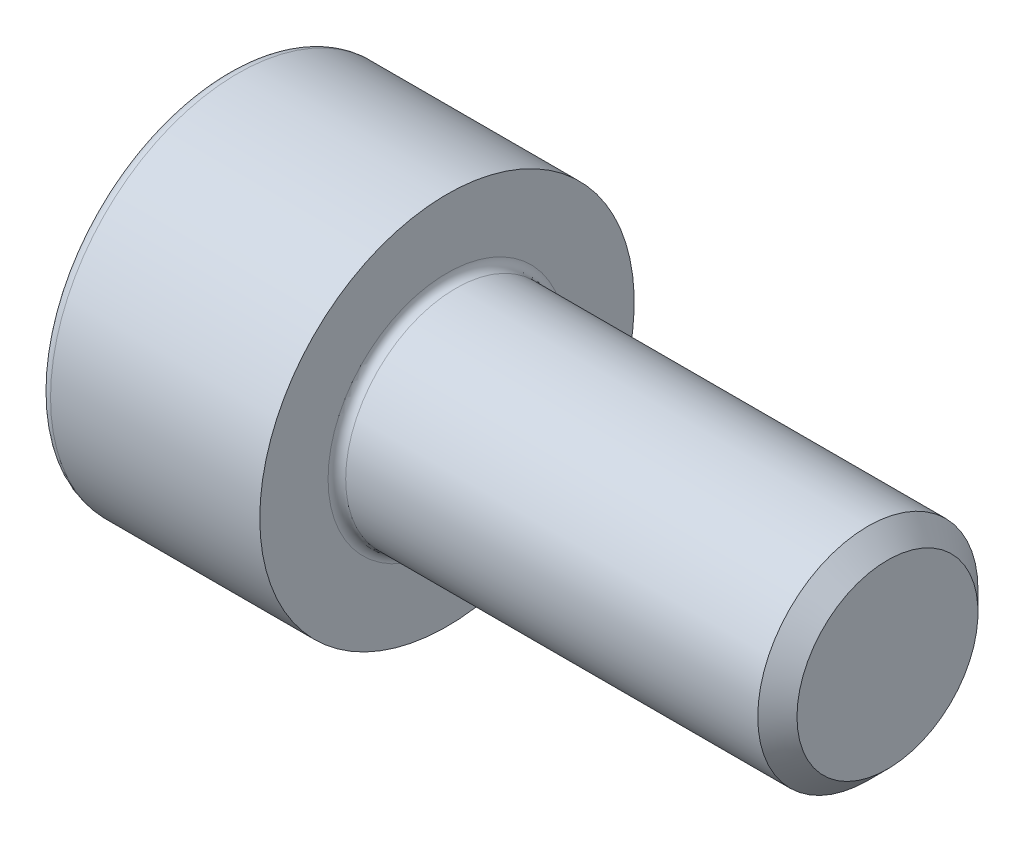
from build123d import *

# Parameters (mm, degrees)
FILLET1_R   = 0.2
FILLET2_R   = 0.25
HEX_2_DEPTH = 2.5


with BuildPart() as part:
    # BodySke → Base-Revolve (revolve)
    with BuildSketch(Plane.XY, mode=Mode.PRIVATE) as base_revolve_sk:
        Polygon((0, 0), (0, 4.25), (5, 4.25), (5, 2.5), (14.555, 2.5), (15, 2.055), (15, 0), align=None)
    revolve(base_revolve_sk.sketch.rotate(Axis((-31.75, 0, 0), (1, 0, 0)), 90), axis=Axis((-31.75, 0, 0), (1, 0, 0)))

    # Fillet1
    fillet1_edges = [part.edges().sort_by_distance(p)[0] for p in [
        (5, 0, -2.5),
    ]]
    fillet(fillet1_edges, radius=FILLET1_R)

    # Fillet2
    fillet2_edges = [part.edges().sort_by_distance(p)[0] for p in [
        (0, 0, -4.25),
    ]]
    fillet(fillet2_edges, radius=FILLET2_R)

    # Sketch2 → Hex-PreBroach (revolve, cut)
    with BuildSketch(Plane.XY, mode=Mode.PRIVATE) as hex_prebroach_sk:
        Polygon((0, 2.042), (2.5, 2.042), (3.67894925, 0), (0, 0), align=None)
    revolve(hex_prebroach_sk.sketch.rotate(Axis((0, 0, 0), (1, 0, 0)), 90), axis=Axis((0, 0, 0), (1, 0, 0)), mode=Mode.SUBTRACT)

    # Sketch3 → Hex 2 (cut)
    with BuildSketch(Plane(origin=(0, 0, 0), x_dir=(0, 0.500000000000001, 0.866025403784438), z_dir=(-1, 0, 0))):
        Polygon((1.17894925, 2.042), (-1.17894925, 2.042), (-2.357898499, 0), (-1.17894925, -2.042), (1.17894925, -2.042), (2.357898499, 0), align=None)
    extrude(amount=-HEX_2_DEPTH, mode=Mode.SUBTRACT)


solid = part.part
